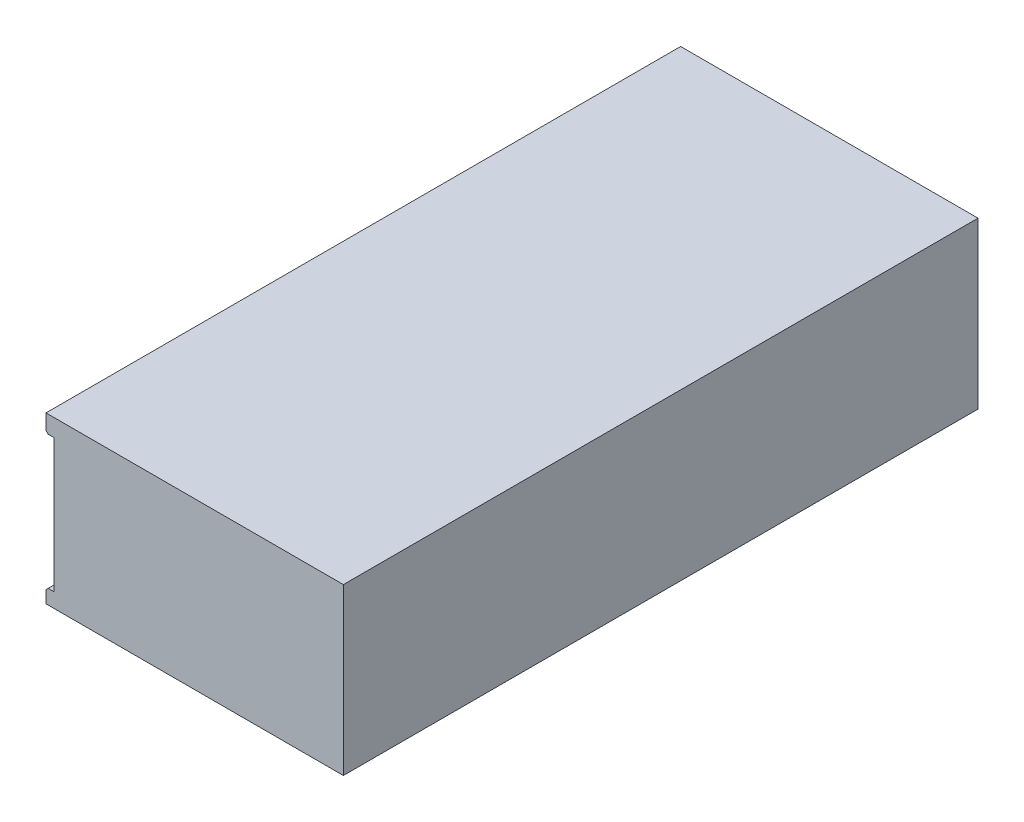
from build123d import *

# Parameters (mm, degrees)
EXTRUDE1_DEPTH                   = 55.5625
F_10_32_TAPPED_HOLE1_D           = 4.0386
F_10_32_TAPPED_HOLE1_DEPTH       = 9.99744
F_10_32_TAPPED_HOLE1_CBORE_D     = 4.826
F_10_32_TAPPED_HOLE1_CBORE_DEPTH = 7.62
F_10_32_TAPPED_HOLE1_TIP         = 1.213317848
CHAMFER1_SIZE                    = 0.381


with BuildPart() as part:
    # Sketch1 → Extrude1 (new, symmetric)
    with BuildSketch(Plane.XY):
        Polygon((50.673, 0), (50.673, -28.956), (-1.397, -28.956), (-1.397, -26.416), (0, -26.416), (0, -3.048), (-1.397, -3.048), (-1.397, 0), align=None)
    extrude(amount=EXTRUDE1_DEPTH, both=True)

    # 10-32 Tapped Hole1
    with Locations(Plane(origin=(0, -6.35, -50.2666), x_dir=(0, 0, -1), z_dir=(-1, 0, 0))):
        with Locations((0, 0), (-100.5332, 0), (-55.1434, 0), (-45.3898, 0), (0, 16.764), (-45.3898, 16.764), (-55.1434, 16.764), (-100.5332, 16.764)):
            CounterBoreHole(F_10_32_TAPPED_HOLE1_D / 2, F_10_32_TAPPED_HOLE1_CBORE_D / 2, F_10_32_TAPPED_HOLE1_CBORE_DEPTH, depth=F_10_32_TAPPED_HOLE1_DEPTH)
            with Locations((0, 0, -(F_10_32_TAPPED_HOLE1_DEPTH + F_10_32_TAPPED_HOLE1_TIP / 2))):  # 118° drill point
                Cone(0, F_10_32_TAPPED_HOLE1_D / 2, F_10_32_TAPPED_HOLE1_TIP, mode=Mode.SUBTRACT)

    # Chamfer1
    chamfer1_edges = [part.edges().sort_by_distance(p)[0] for p in [
        (-1.397, -26.416, 0),
        (-1.397, -3.048, 0),
    ]]
    chamfer(chamfer1_edges, length=CHAMFER1_SIZE)


solid = part.part
